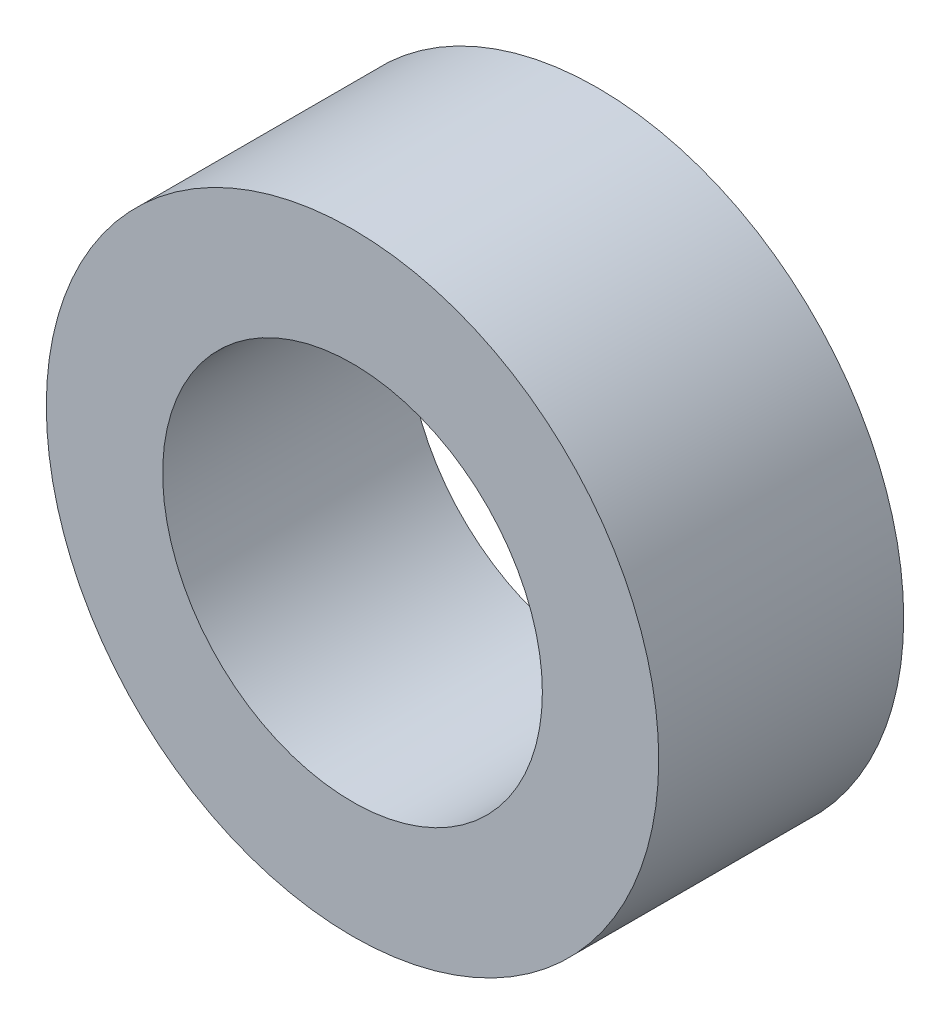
from build123d import *

# Parameters (mm, degrees)
SKETCH_1_R                        = 5
SKETCH_1_R_2                      = 3.1
FLANGED_PIVOT_BUSH_ENVELOPE_DEPTH = 2


with BuildPart() as part:
    # Sketch 1 → Flanged_Pivot_Bush_Envelope (new, symmetric)
    with BuildSketch(Plane.XY):
        Circle(SKETCH_1_R)
        Circle(SKETCH_1_R_2, mode=Mode.SUBTRACT)
    extrude(amount=FLANGED_PIVOT_BUSH_ENVELOPE_DEPTH, both=True)


solid = part.part
